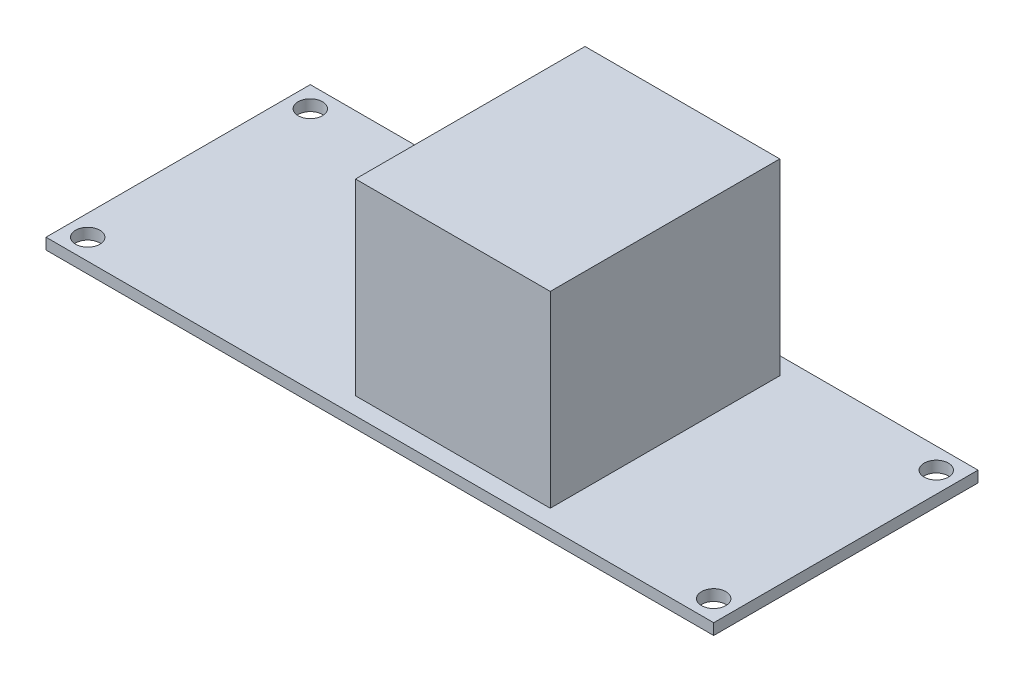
from build123d import *

# Parameters (mm, degrees)
SKETCH_1_W      = 96
SKETCH_1_H      = 38
SKETCH_1_R      = 1.75
EXTRUDE_1_DEPTH = 1.6
SKETCH_2_W      = 28
SKETCH_2_H      = 33
EXTRUDE_2_DEPTH = 27


with BuildPart() as part:
    # Sketch 1 → Extrude 1 (new body)
    with BuildSketch(Plane(origin=(0, 0, 0), x_dir=(1, 0, 0), z_dir=(0, 1, 0))):
        Rectangle(SKETCH_1_W, SKETCH_1_H)
        with Locations(Location((-45, 16, 0), (0, 0, 270))):
            Circle(SKETCH_1_R, mode=Mode.SUBTRACT)
        with Locations(Location((-45, -16, 0), (0, 0, 270))):
            Circle(SKETCH_1_R, mode=Mode.SUBTRACT)
        with Locations(Location((45, -16, 0), (0, 0, 270))):
            Circle(SKETCH_1_R, mode=Mode.SUBTRACT)
        with Locations(Location((45, 16, 0), (0, 0, 270))):
            Circle(SKETCH_1_R, mode=Mode.SUBTRACT)
    extrude(amount=EXTRUDE_1_DEPTH)

    # Sketch 2 → Extrude 2 (add)
    with BuildSketch(Plane(origin=(0, 1.6, 0), x_dir=(1, 0, 0), z_dir=(0, 1, 0))):
        with Locations((8, 0)):
            Rectangle(SKETCH_2_W, SKETCH_2_H)
    extrude(amount=EXTRUDE_2_DEPTH)


solid = part.part
